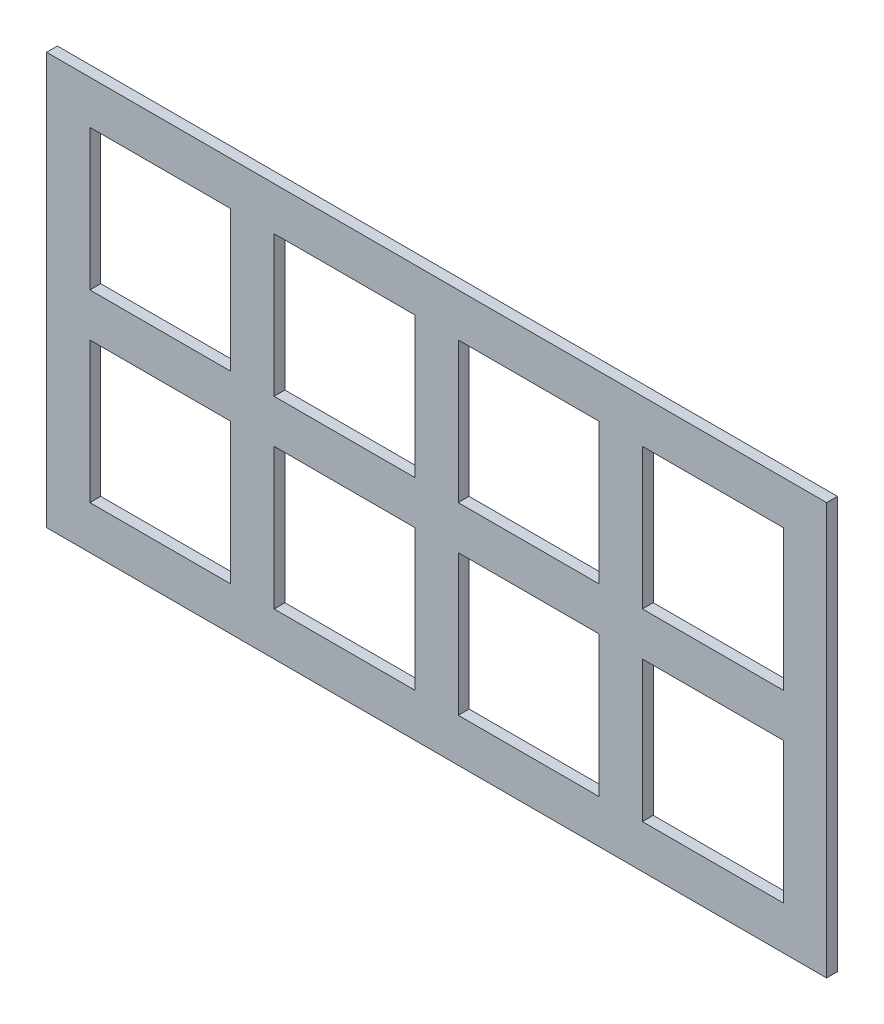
from build123d import *

# Parameters (mm, degrees)
SKETCH1_W           = 914.4
SKETCH1_H           = 482.6
SKETCH1_W_2         = 165.1
SKETCH1_H_2         = 165.1
BOSS_EXTRUDE1_DEPTH = 12.7


with BuildPart() as part:
    # Sketch1 → Boss-Extrude1 (new body)
    with BuildSketch(Plane.XY):
        Rectangle(SKETCH1_W, SKETCH1_H)
        with Locations((107.95, 107.95)):
            Rectangle(SKETCH1_W_2, SKETCH1_H_2, mode=Mode.SUBTRACT)
        with Locations((323.85, 107.95)):
            Rectangle(SKETCH1_W_2, SKETCH1_H_2, mode=Mode.SUBTRACT)
        with Locations((-323.85, -107.95)):
            Rectangle(SKETCH1_W_2, SKETCH1_H_2, mode=Mode.SUBTRACT)
        with Locations((-323.85, 107.95)):
            Rectangle(SKETCH1_W_2, SKETCH1_H_2, mode=Mode.SUBTRACT)
        with Locations((323.85, -107.95)):
            Rectangle(SKETCH1_W_2, SKETCH1_H_2, mode=Mode.SUBTRACT)
        with Locations((-107.95, -107.95)):
            Rectangle(SKETCH1_W_2, SKETCH1_H_2, mode=Mode.SUBTRACT)
        with Locations((107.95, -107.95)):
            Rectangle(SKETCH1_W_2, SKETCH1_H_2, mode=Mode.SUBTRACT)
        with Locations((-107.95, 107.95)):
            Rectangle(SKETCH1_W_2, SKETCH1_H_2, mode=Mode.SUBTRACT)
    extrude(amount=BOSS_EXTRUDE1_DEPTH)


solid = part.part
